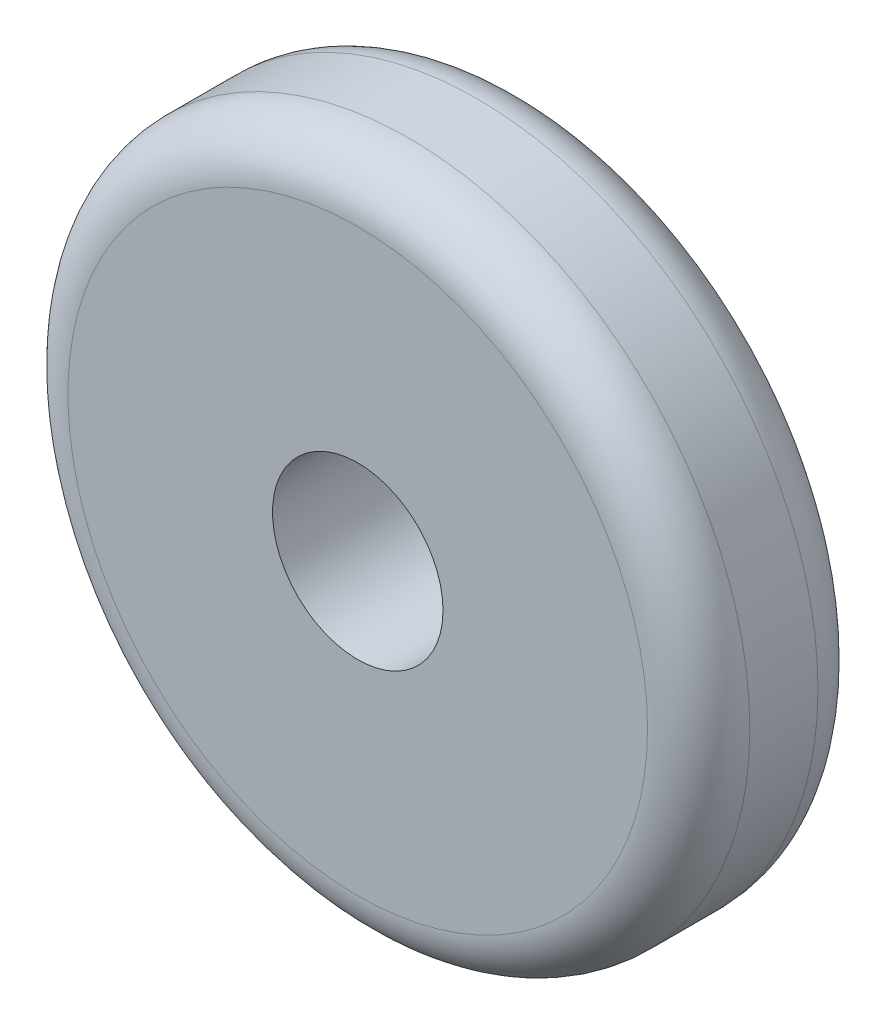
from build123d import *

# Parameters (mm, degrees)
SKETCH_1_R      = 20
SKETCH_1_R_2    = 5
EXTRUDE_1_DEPTH = 10
FILLET_1_R      = 3


with BuildPart() as part:
    # Sketch 1 → Extrude 1 (new body)
    with BuildSketch(Plane.XY):
        with Locations((-21.150326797, 29.962962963)):
            Circle(SKETCH_1_R)
        with Locations((-21.150326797, 29.962962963)):
            Circle(SKETCH_1_R_2, mode=Mode.SUBTRACT)
    extrude(amount=EXTRUDE_1_DEPTH)

    # Fillet 1
    fillet_1_edges = [part.edges().sort_by_distance(p)[0] for p in [
        (-41.150326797, 29.962962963, 0),
        (-41.150326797, 29.962962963, 10),
    ]]
    fillet(fillet_1_edges, radius=FILLET_1_R)


solid = part.part
